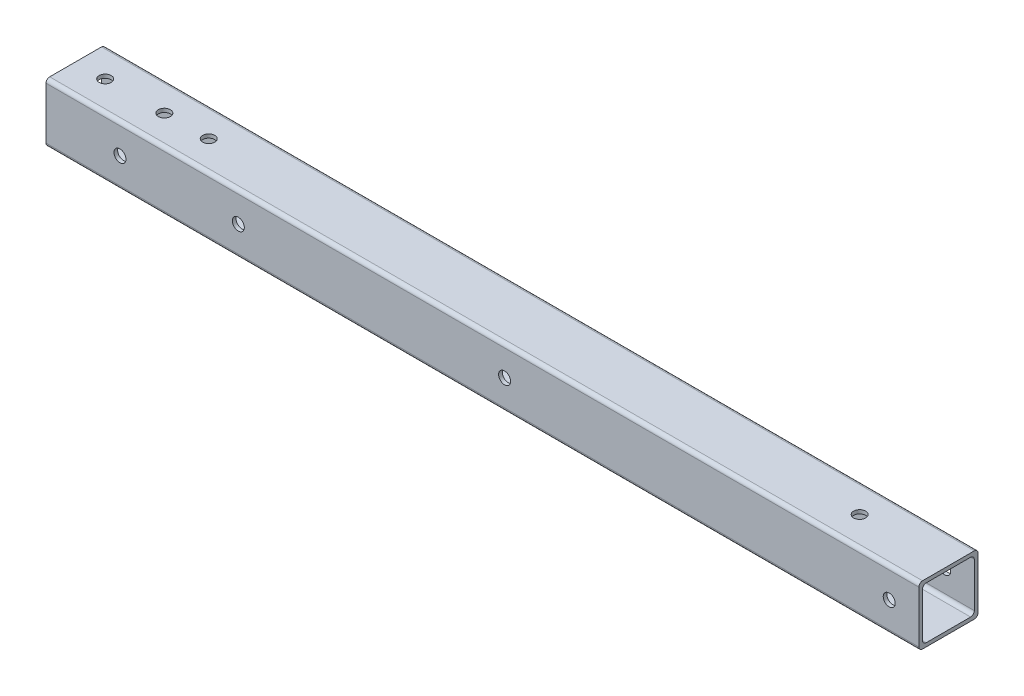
from build123d import *

# Parameters (mm, degrees)
SKETCH1_W          = 1498.6
SKETCH1_H          = 101.6
EXTRUDE1_DEPTH     = 101.6
CUT_EXTRUDE1_REACH = 1507.472
SKETCH2_W          = 88.9
SKETCH2_H          = 88.9
FILLET1_R          = 6.35
SKETCH3_R          = 10.31875
CUT_EXTRUDE2_DEPTH = 101.6
SKETCH4_R          = 10.31875
CUT_EXTRUDE3_DEPTH = 101.6
SKETCH5_R          = 10.31875
CUT_EXTRUDE4_DEPTH = 101.6
SKETCH6_R          = 10.31875
CUT_EXTRUDE5_DEPTH = 101.6
SKETCH7_R          = 10.31875
CUT_EXTRUDE6_DEPTH = 101.6
SKETCH8_R          = 10.31875
CUT_EXTRUDE7_DEPTH = 101.6
SKETCH9_R          = 10.31875
CUT_EXTRUDE8_DEPTH = 1506.472377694
SKETCH10_R         = 10.31875
CUT_EXTRUDE9_DEPTH = 1506.472377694


with BuildPart() as part:
    # Sketch1 → Extrude1 (new body)
    with BuildSketch(Plane(origin=(0, 0, 0), x_dir=(1, 0, 0), z_dir=(0, 1, 0))):
        with Locations((-749.3, -50.8)):
            Rectangle(SKETCH1_W, SKETCH1_H)
    extrude(amount=EXTRUDE1_DEPTH)

    # Sketch2 → Cut-Extrude1 (cut, up to next)
    with BuildSketch(Plane.ZY.offset(1498.6), mode=Mode.PRIVATE) as cut_extrude1_sk1:
        with Locations((50.8, 50.8)):
            Rectangle(SKETCH2_W, SKETCH2_H)
    cut_extrude1_tool1 = extrude(cut_extrude1_sk1.sketch, amount=-CUT_EXTRUDE1_REACH, mode=Mode.PRIVATE) & part.part
    add(cut_extrude1_tool1.solids().sort_by_distance((-1498.6, 50.8, 50.8))[0], mode=Mode.SUBTRACT)

    # Fillet1
    fillet1_edges = [part.edges().sort_by_distance(p)[0] for p in [
        (-749.3, 101.6, 101.6),
        (-749.3, 6.35, 6.35),
        (-749.3, 95.25, 6.35),
        (-749.3, 95.25, 95.25),
        (-749.3, 6.35, 95.25),
        (-749.3, 0, 101.6),
        (-749.3, 0, 0),
        (-749.3, 101.6, 0),
    ]]
    fillet(fillet1_edges, radius=FILLET1_R)

    # Sketch3 → Cut-Extrude2 (cut)
    with BuildSketch(Plane.XZ):
        with Locations(Location((-1447.8, 50.8, 0), (0, 0, 270))):
            Circle(SKETCH3_R)
    extrude(amount=-CUT_EXTRUDE2_DEPTH, mode=Mode.SUBTRACT)

    # Sketch4 → Cut-Extrude3 (cut)
    with BuildSketch(Plane.XZ):
        with Locations(Location((-1346.2, 50.8, 0), (0, 0, 270))):
            Circle(SKETCH4_R)
    extrude(amount=-CUT_EXTRUDE3_DEPTH, mode=Mode.SUBTRACT)

    # Sketch5 → Cut-Extrude4 (cut)
    with BuildSketch(Plane.XZ):
        with Locations(Location((-1270, 50.8, 0), (0, 0, 270))):
            Circle(SKETCH5_R)
    extrude(amount=-CUT_EXTRUDE4_DEPTH, mode=Mode.SUBTRACT)

    # Sketch6 → Cut-Extrude5 (cut)
    with BuildSketch(Plane.XZ):
        with Locations(Location((-152.4, 50.8, 0), (0, 0, 270))):
            Circle(SKETCH6_R)
    extrude(amount=-CUT_EXTRUDE5_DEPTH, mode=Mode.SUBTRACT)

    # Sketch7 → Cut-Extrude6 (cut)
    with BuildSketch(Plane.XY.offset(101.6)):
        with Locations((-1371.6, 50.8)):
            Circle(SKETCH7_R)
    extrude(amount=-CUT_EXTRUDE6_DEPTH, mode=Mode.SUBTRACT)

    # Sketch8 → Cut-Extrude7 (cut)
    with BuildSketch(Plane.XY.offset(101.6)):
        with Locations((-50.8, 50.8)):
            Circle(SKETCH8_R)
    extrude(amount=-CUT_EXTRUDE7_DEPTH, mode=Mode.SUBTRACT)

    # Sketch9 → Cut-Extrude8 (cut, through all)
    with BuildSketch(Plane.XY.offset(101.6)):
        with Locations((-711.2, 50.8)):
            Circle(SKETCH9_R)
    extrude(amount=-CUT_EXTRUDE8_DEPTH, mode=Mode.SUBTRACT)

    # Sketch10 → Cut-Extrude9 (cut, through all)
    with BuildSketch(Plane.XY.offset(101.6)):
        with Locations((-1168.4, 50.8)):
            Circle(SKETCH10_R)
    extrude(amount=-CUT_EXTRUDE9_DEPTH, mode=Mode.SUBTRACT)


solid = part.part
